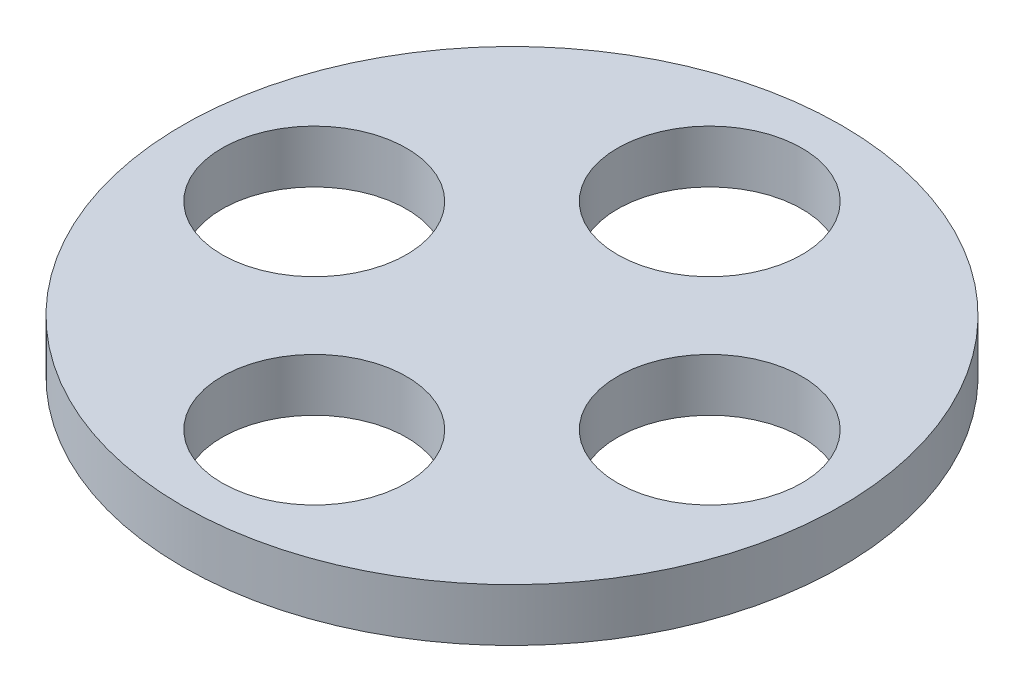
ISO-10303-21;
HEADER;
FILE_DESCRIPTION(('STEP AP214'),'2;1');
FILE_NAME('part.step','',(''),(''),'','','');
FILE_SCHEMA(('AUTOMOTIVE_DESIGN { 1 0 10303 214 1 1 1 1 }'));
ENDSEC;
DATA;
#1=APPLICATION_CONTEXT('core data for automotive mechanical design processes');
#2=APPLICATION_PROTOCOL_DEFINITION('international standard','automotive_design',2000,#1);
#3=PRODUCT_CONTEXT('',#1,'mechanical');
#4=PRODUCT('Part','Part','',(#3));
#5=PRODUCT_RELATED_PRODUCT_CATEGORY('part','',(#4));
#6=PRODUCT_DEFINITION_FORMATION('','',#4);
#7=PRODUCT_DEFINITION_CONTEXT('part definition',#1,'design');
#8=PRODUCT_DEFINITION('design','',#6,#7);
#9=PRODUCT_DEFINITION_SHAPE('','',#8);
#10=(LENGTH_UNIT() NAMED_UNIT(*) SI_UNIT(.MILLI.,.METRE.));
#11=(NAMED_UNIT(*) PLANE_ANGLE_UNIT() SI_UNIT($,.RADIAN.));
#12=(NAMED_UNIT(*) SI_UNIT($,.STERADIAN.) SOLID_ANGLE_UNIT());
#13=UNCERTAINTY_MEASURE_WITH_UNIT(LENGTH_MEASURE(1.E-05),#10,'distance_accuracy_value','');
#14=(GEOMETRIC_REPRESENTATION_CONTEXT(3) GLOBAL_UNCERTAINTY_ASSIGNED_CONTEXT((#13)) GLOBAL_UNIT_ASSIGNED_CONTEXT((#10,
#11,#12)) REPRESENTATION_CONTEXT('',''));
#15=CARTESIAN_POINT('',(0.,0.,0.));
#16=DIRECTION('',(0.,0.,1.));
#17=DIRECTION('',(1.,0.,0.));
#18=AXIS2_PLACEMENT_3D('',#15,#16,#17);
#19=CARTESIAN_POINT('',(0.,20.,0.));
#20=DIRECTION('',(0.,-1.,0.));
#21=DIRECTION('',(0.,0.,-1.));
#22=AXIS2_PLACEMENT_3D('',#19,#20,#21);
#23=CYLINDRICAL_SURFACE('',#22,125.);
#24=CARTESIAN_POINT('',(0.,20.,0.));
#25=DIRECTION('',(0.,1.,0.));
#26=DIRECTION('',(0.,0.,1.));
#27=AXIS2_PLACEMENT_3D('',#24,#25,#26);
#28=CIRCLE('',#27,125.);
#29=CARTESIAN_POINT('',(0.,20.,125.));
#30=VERTEX_POINT('',#29);
#31=EDGE_CURVE('E10',#30,#30,#28,.T.);
#32=ORIENTED_EDGE('',*,*,#31,.F.);
#33=EDGE_LOOP('',(#32));
#34=FACE_BOUND('',#33,.T.);
#35=CARTESIAN_POINT('',(0.,0.,0.));
#36=DIRECTION('',(0.,1.,0.));
#37=DIRECTION('',(0.,0.,1.));
#38=AXIS2_PLACEMENT_3D('',#35,#36,#37);
#39=CIRCLE('',#38,125.);
#40=CARTESIAN_POINT('',(0.,0.,125.));
#41=VERTEX_POINT('',#40);
#42=EDGE_CURVE('E37',#41,#41,#39,.T.);
#43=ORIENTED_EDGE('',*,*,#42,.T.);
#44=EDGE_LOOP('',(#43));
#45=FACE_BOUND('',#44,.T.);
#46=ADVANCED_FACE('F34',(#34,#45),#23,.T.);
#47=CARTESIAN_POINT('',(0.,20.,0.));
#48=DIRECTION('',(0.,1.,0.));
#49=DIRECTION('',(0.,0.,1.));
#50=AXIS2_PLACEMENT_3D('',#47,#48,#49);
#51=PLANE('',#50);
#52=CARTESIAN_POINT('',(0.,20.,-75.));
#53=DIRECTION('',(0.,1.,0.));
#54=DIRECTION('',(0.,0.,1.));
#55=AXIS2_PLACEMENT_3D('',#52,#53,#54);
#56=CIRCLE('',#55,35.);
#57=CARTESIAN_POINT('',(0.,20.,-40.));
#58=VERTEX_POINT('',#57);
#59=EDGE_CURVE('E64',#58,#58,#56,.T.);
#60=ORIENTED_EDGE('',*,*,#59,.F.);
#61=EDGE_LOOP('',(#60));
#62=FACE_BOUND('',#61,.T.);
#63=CARTESIAN_POINT('',(-74.9999999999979,20.,2.1270357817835E-12));
#64=DIRECTION('',(0.,1.,0.));
#65=DIRECTION('',(0.,0.,1.));
#66=AXIS2_PLACEMENT_3D('',#63,#64,#65);
#67=CIRCLE('',#66,35.0000000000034);
#68=CARTESIAN_POINT('',(-74.9999999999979,20.,35.0000000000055));
#69=VERTEX_POINT('',#68);
#70=EDGE_CURVE('E61',#69,#69,#67,.T.);
#71=ORIENTED_EDGE('',*,*,#70,.F.);
#72=EDGE_LOOP('',(#71));
#73=FACE_BOUND('',#72,.T.);
#74=CARTESIAN_POINT('',(4.23570186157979E-12,20.,75.));
#75=DIRECTION('',(0.,1.,0.));
#76=DIRECTION('',(0.,0.,1.));
#77=AXIS2_PLACEMENT_3D('',#74,#75,#76);
#78=CIRCLE('',#77,35.0000000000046);
#79=CARTESIAN_POINT('',(4.23570186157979E-12,20.,110.000000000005));
#80=VERTEX_POINT('',#79);
#81=EDGE_CURVE('E55',#80,#80,#78,.T.);
#82=ORIENTED_EDGE('',*,*,#81,.F.);
#83=EDGE_LOOP('',(#82));
#84=FACE_BOUND('',#83,.T.);
#85=CARTESIAN_POINT('',(75.0000000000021,20.,-2.11785093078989E-12));
#86=DIRECTION('',(0.,1.,0.));
#87=DIRECTION('',(0.,0.,1.));
#88=AXIS2_PLACEMENT_3D('',#85,#86,#87);
#89=CIRCLE('',#88,35.0000000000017);
#90=CARTESIAN_POINT('',(75.0000000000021,20.,34.9999999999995));
#91=VERTEX_POINT('',#90);
#92=EDGE_CURVE('E49',#91,#91,#89,.T.);
#93=ORIENTED_EDGE('',*,*,#92,.F.);
#94=EDGE_LOOP('',(#93));
#95=FACE_BOUND('',#94,.T.);
#96=ORIENTED_EDGE('',*,*,#31,.T.);
#97=EDGE_LOOP('',(#96));
#98=FACE_BOUND('',#97,.T.);
#99=ADVANCED_FACE('F80',(#62,#73,#84,#95,#98),#51,.T.);
#100=CARTESIAN_POINT('',(0.,0.,0.));
#101=DIRECTION('',(0.,1.,0.));
#102=DIRECTION('',(0.,0.,1.));
#103=AXIS2_PLACEMENT_3D('',#100,#101,#102);
#104=PLANE('',#103);
#105=CARTESIAN_POINT('',(0.,0.,-75.));
#106=DIRECTION('',(0.,1.,0.));
#107=DIRECTION('',(0.,0.,1.));
#108=AXIS2_PLACEMENT_3D('',#105,#106,#107);
#109=CIRCLE('',#108,35.);
#110=CARTESIAN_POINT('',(0.,0.,-40.));
#111=VERTEX_POINT('',#110);
#112=EDGE_CURVE('E44',#111,#111,#109,.T.);
#113=ORIENTED_EDGE('',*,*,#112,.T.);
#114=EDGE_LOOP('',(#113));
#115=FACE_BOUND('',#114,.T.);
#116=CARTESIAN_POINT('',(-74.9999999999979,0.,2.1270357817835E-12));
#117=DIRECTION('',(0.,1.,0.));
#118=DIRECTION('',(0.,0.,1.));
#119=AXIS2_PLACEMENT_3D('',#116,#117,#118);
#120=CIRCLE('',#119,35.0000000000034);
#121=CARTESIAN_POINT('',(-74.9999999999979,0.,35.0000000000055));
#122=VERTEX_POINT('',#121);
#123=EDGE_CURVE('E58',#122,#122,#120,.T.);
#124=ORIENTED_EDGE('',*,*,#123,.T.);
#125=EDGE_LOOP('',(#124));
#126=FACE_BOUND('',#125,.T.);
#127=CARTESIAN_POINT('',(4.23570186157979E-12,0.,75.));
#128=DIRECTION('',(0.,1.,0.));
#129=DIRECTION('',(0.,0.,1.));
#130=AXIS2_PLACEMENT_3D('',#127,#128,#129);
#131=CIRCLE('',#130,35.0000000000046);
#132=CARTESIAN_POINT('',(4.23570186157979E-12,0.,110.000000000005));
#133=VERTEX_POINT('',#132);
#134=EDGE_CURVE('E52',#133,#133,#131,.T.);
#135=ORIENTED_EDGE('',*,*,#134,.T.);
#136=EDGE_LOOP('',(#135));
#137=FACE_BOUND('',#136,.T.);
#138=CARTESIAN_POINT('',(75.0000000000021,0.,-2.11785093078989E-12));
#139=DIRECTION('',(0.,1.,0.));
#140=DIRECTION('',(0.,0.,1.));
#141=AXIS2_PLACEMENT_3D('',#138,#139,#140);
#142=CIRCLE('',#141,35.0000000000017);
#143=CARTESIAN_POINT('',(75.0000000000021,0.,34.9999999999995));
#144=VERTEX_POINT('',#143);
#145=EDGE_CURVE('E46',#144,#144,#142,.T.);
#146=ORIENTED_EDGE('',*,*,#145,.T.);
#147=EDGE_LOOP('',(#146));
#148=FACE_BOUND('',#147,.T.);
#149=ORIENTED_EDGE('',*,*,#42,.F.);
#150=EDGE_LOOP('',(#149));
#151=FACE_BOUND('',#150,.T.);
#152=ADVANCED_FACE('F70',(#115,#126,#137,#148,#151),#104,.F.);
#153=CARTESIAN_POINT('',(75.0000000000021,0.,-2.11785093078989E-12));
#154=DIRECTION('',(0.,1.,0.));
#155=DIRECTION('',(0.,0.,1.));
#156=AXIS2_PLACEMENT_3D('',#153,#154,#155);
#157=CYLINDRICAL_SURFACE('',#156,35.0000000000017);
#158=ORIENTED_EDGE('',*,*,#145,.F.);
#159=EDGE_LOOP('',(#158));
#160=FACE_BOUND('',#159,.T.);
#161=ORIENTED_EDGE('',*,*,#92,.T.);
#162=EDGE_LOOP('',(#161));
#163=FACE_BOUND('',#162,.T.);
#164=ADVANCED_FACE('F90',(#160,#163),#157,.F.);
#165=CARTESIAN_POINT('',(4.23570186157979E-12,0.,75.));
#166=DIRECTION('',(0.,1.,0.));
#167=DIRECTION('',(0.,0.,1.));
#168=AXIS2_PLACEMENT_3D('',#165,#166,#167);
#169=CYLINDRICAL_SURFACE('',#168,35.0000000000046);
#170=ORIENTED_EDGE('',*,*,#134,.F.);
#171=EDGE_LOOP('',(#170));
#172=FACE_BOUND('',#171,.T.);
#173=ORIENTED_EDGE('',*,*,#81,.T.);
#174=EDGE_LOOP('',(#173));
#175=FACE_BOUND('',#174,.T.);
#176=ADVANCED_FACE('F92',(#172,#175),#169,.F.);
#177=CARTESIAN_POINT('',(-74.9999999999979,0.,2.1270357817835E-12));
#178=DIRECTION('',(0.,1.,0.));
#179=DIRECTION('',(0.,0.,1.));
#180=AXIS2_PLACEMENT_3D('',#177,#178,#179);
#181=CYLINDRICAL_SURFACE('',#180,35.0000000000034);
#182=ORIENTED_EDGE('',*,*,#123,.F.);
#183=EDGE_LOOP('',(#182));
#184=FACE_BOUND('',#183,.T.);
#185=ORIENTED_EDGE('',*,*,#70,.T.);
#186=EDGE_LOOP('',(#185));
#187=FACE_BOUND('',#186,.T.);
#188=ADVANCED_FACE('F76',(#184,#187),#181,.F.);
#189=CARTESIAN_POINT('',(0.,0.,-75.));
#190=DIRECTION('',(0.,1.,0.));
#191=DIRECTION('',(0.,0.,1.));
#192=AXIS2_PLACEMENT_3D('',#189,#190,#191);
#193=CYLINDRICAL_SURFACE('',#192,35.);
#194=ORIENTED_EDGE('',*,*,#112,.F.);
#195=EDGE_LOOP('',(#194));
#196=FACE_BOUND('',#195,.T.);
#197=ORIENTED_EDGE('',*,*,#59,.T.);
#198=EDGE_LOOP('',(#197));
#199=FACE_BOUND('',#198,.T.);
#200=ADVANCED_FACE('F73',(#196,#199),#193,.F.);
#201=CLOSED_SHELL('',(#46,#99,#152,#164,#176,#188,#200));
#202=MANIFOLD_SOLID_BREP('B2',#201);
#203=ADVANCED_BREP_SHAPE_REPRESENTATION('',(#18,#202),#14);
#204=SHAPE_DEFINITION_REPRESENTATION(#9,#203);
ENDSEC;
END-ISO-10303-21;
